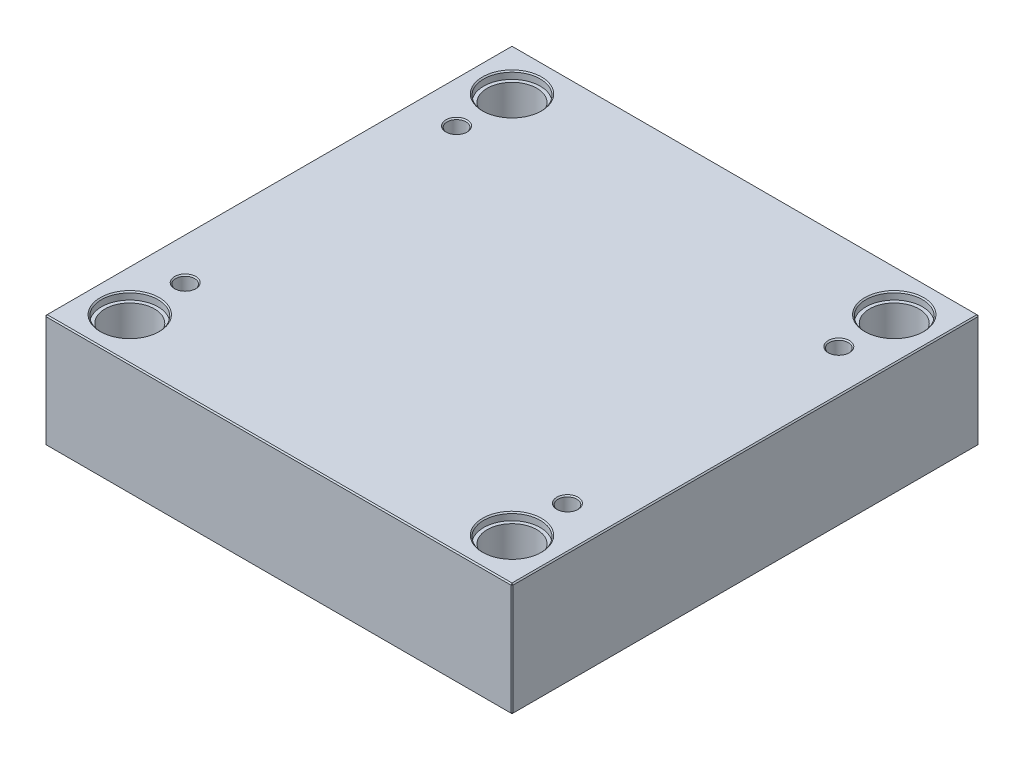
ISO-10303-21;
HEADER;
FILE_DESCRIPTION(('STEP AP214'),'2;1');
FILE_NAME('part.step','',(''),(''),'','','');
FILE_SCHEMA(('AUTOMOTIVE_DESIGN { 1 0 10303 214 1 1 1 1 }'));
ENDSEC;
DATA;
#1=APPLICATION_CONTEXT('core data for automotive mechanical design processes');
#2=APPLICATION_PROTOCOL_DEFINITION('international standard','automotive_design',2000,#1);
#3=PRODUCT_CONTEXT('',#1,'mechanical');
#4=PRODUCT('Part','Part','',(#3));
#5=PRODUCT_RELATED_PRODUCT_CATEGORY('part','',(#4));
#6=PRODUCT_DEFINITION_FORMATION('','',#4);
#7=PRODUCT_DEFINITION_CONTEXT('part definition',#1,'design');
#8=PRODUCT_DEFINITION('design','',#6,#7);
#9=PRODUCT_DEFINITION_SHAPE('','',#8);
#10=(LENGTH_UNIT() NAMED_UNIT(*) SI_UNIT(.MILLI.,.METRE.));
#11=(NAMED_UNIT(*) PLANE_ANGLE_UNIT() SI_UNIT($,.RADIAN.));
#12=(NAMED_UNIT(*) SI_UNIT($,.STERADIAN.) SOLID_ANGLE_UNIT());
#13=UNCERTAINTY_MEASURE_WITH_UNIT(LENGTH_MEASURE(1.E-05),#10,'distance_accuracy_value','');
#14=(GEOMETRIC_REPRESENTATION_CONTEXT(3) GLOBAL_UNCERTAINTY_ASSIGNED_CONTEXT((#13)) GLOBAL_UNIT_ASSIGNED_CONTEXT((#10,
#11,#12)) REPRESENTATION_CONTEXT('',''));
#15=CARTESIAN_POINT('',(0.,0.,0.));
#16=DIRECTION('',(0.,0.,1.));
#17=DIRECTION('',(1.,0.,0.));
#18=AXIS2_PLACEMENT_3D('',#15,#16,#17);
#19=CARTESIAN_POINT('',(-162.,0.,-162.));
#20=DIRECTION('',(0.,1.,0.));
#21=DIRECTION('',(0.,0.,1.));
#22=AXIS2_PLACEMENT_3D('',#19,#20,#21);
#23=CYLINDRICAL_SURFACE('',#22,21.);
#24=CARTESIAN_POINT('',(-162.,0.999999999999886,-162.));
#25=DIRECTION('',(0.,1.,0.));
#26=DIRECTION('',(0.,0.,1.));
#27=AXIS2_PLACEMENT_3D('',#24,#25,#26);
#28=CIRCLE('',#27,21.);
#29=CARTESIAN_POINT('',(-162.,0.999999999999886,-141.));
#30=VERTEX_POINT('',#29);
#31=EDGE_CURVE('E472',#30,#30,#28,.F.);
#32=ORIENTED_EDGE('',*,*,#31,.T.);
#33=EDGE_LOOP('',(#32));
#34=FACE_BOUND('',#33,.T.);
#35=CARTESIAN_POINT('',(-162.,89.7,-162.));
#36=DIRECTION('',(0.,1.,0.));
#37=DIRECTION('',(0.,0.,1.));
#38=AXIS2_PLACEMENT_3D('',#35,#36,#37);
#39=CIRCLE('',#38,21.);
#40=CARTESIAN_POINT('',(-162.,89.7,-141.));
#41=VERTEX_POINT('',#40);
#42=EDGE_CURVE('E221',#41,#41,#39,.F.);
#43=ORIENTED_EDGE('',*,*,#42,.F.);
#44=EDGE_LOOP('',(#43));
#45=FACE_BOUND('',#44,.T.);
#46=ADVANCED_FACE('F16',(#34,#45),#23,.F.);
#47=CARTESIAN_POINT('',(162.,0.,-162.));
#48=DIRECTION('',(0.,1.,0.));
#49=DIRECTION('',(0.,0.,1.));
#50=AXIS2_PLACEMENT_3D('',#47,#48,#49);
#51=CYLINDRICAL_SURFACE('',#50,21.);
#52=CARTESIAN_POINT('',(162.,0.999999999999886,-162.));
#53=DIRECTION('',(0.,1.,0.));
#54=DIRECTION('',(0.,0.,1.));
#55=AXIS2_PLACEMENT_3D('',#52,#53,#54);
#56=CIRCLE('',#55,21.);
#57=CARTESIAN_POINT('',(162.,0.999999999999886,-141.));
#58=VERTEX_POINT('',#57);
#59=EDGE_CURVE('E474',#58,#58,#56,.F.);
#60=ORIENTED_EDGE('',*,*,#59,.T.);
#61=EDGE_LOOP('',(#60));
#62=FACE_BOUND('',#61,.T.);
#63=CARTESIAN_POINT('',(162.,89.7,-162.));
#64=DIRECTION('',(0.,1.,0.));
#65=DIRECTION('',(0.,0.,1.));
#66=AXIS2_PLACEMENT_3D('',#63,#64,#65);
#67=CIRCLE('',#66,21.);
#68=CARTESIAN_POINT('',(162.,89.7,-141.));
#69=VERTEX_POINT('',#68);
#70=EDGE_CURVE('E218',#69,#69,#67,.F.);
#71=ORIENTED_EDGE('',*,*,#70,.F.);
#72=EDGE_LOOP('',(#71));
#73=FACE_BOUND('',#72,.T.);
#74=ADVANCED_FACE('F263',(#62,#73),#51,.F.);
#75=CARTESIAN_POINT('',(162.,0.,162.));
#76=DIRECTION('',(0.,1.,0.));
#77=DIRECTION('',(0.,0.,1.));
#78=AXIS2_PLACEMENT_3D('',#75,#76,#77);
#79=CYLINDRICAL_SURFACE('',#78,21.);
#80=CARTESIAN_POINT('',(162.,1.00000000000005,162.));
#81=DIRECTION('',(0.,1.,0.));
#82=DIRECTION('',(0.,0.,1.));
#83=AXIS2_PLACEMENT_3D('',#80,#81,#82);
#84=CIRCLE('',#83,21.);
#85=CARTESIAN_POINT('',(162.,1.00000000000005,183.));
#86=VERTEX_POINT('',#85);
#87=EDGE_CURVE('E477',#86,#86,#84,.F.);
#88=ORIENTED_EDGE('',*,*,#87,.T.);
#89=EDGE_LOOP('',(#88));
#90=FACE_BOUND('',#89,.T.);
#91=CARTESIAN_POINT('',(162.,89.7,162.));
#92=DIRECTION('',(0.,1.,0.));
#93=DIRECTION('',(0.,0.,1.));
#94=AXIS2_PLACEMENT_3D('',#91,#92,#93);
#95=CIRCLE('',#94,21.);
#96=CARTESIAN_POINT('',(162.,89.7,183.));
#97=VERTEX_POINT('',#96);
#98=EDGE_CURVE('E214',#97,#97,#95,.F.);
#99=ORIENTED_EDGE('',*,*,#98,.F.);
#100=EDGE_LOOP('',(#99));
#101=FACE_BOUND('',#100,.T.);
#102=ADVANCED_FACE('F270',(#90,#101),#79,.F.);
#103=CARTESIAN_POINT('',(-162.,0.,162.));
#104=DIRECTION('',(0.,1.,0.));
#105=DIRECTION('',(0.,0.,1.));
#106=AXIS2_PLACEMENT_3D('',#103,#104,#105);
#107=CYLINDRICAL_SURFACE('',#106,21.);
#108=CARTESIAN_POINT('',(-162.,0.999999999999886,162.));
#109=DIRECTION('',(0.,1.,0.));
#110=DIRECTION('',(0.,0.,1.));
#111=AXIS2_PLACEMENT_3D('',#108,#109,#110);
#112=CIRCLE('',#111,21.);
#113=CARTESIAN_POINT('',(-162.,0.999999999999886,183.));
#114=VERTEX_POINT('',#113);
#115=EDGE_CURVE('E480',#114,#114,#112,.F.);
#116=ORIENTED_EDGE('',*,*,#115,.T.);
#117=EDGE_LOOP('',(#116));
#118=FACE_BOUND('',#117,.T.);
#119=CARTESIAN_POINT('',(-162.,89.7,162.));
#120=DIRECTION('',(0.,1.,0.));
#121=DIRECTION('',(0.,0.,1.));
#122=AXIS2_PLACEMENT_3D('',#119,#120,#121);
#123=CIRCLE('',#122,21.);
#124=CARTESIAN_POINT('',(-162.,89.7,183.));
#125=VERTEX_POINT('',#124);
#126=EDGE_CURVE('E211',#125,#125,#123,.F.);
#127=ORIENTED_EDGE('',*,*,#126,.F.);
#128=EDGE_LOOP('',(#127));
#129=FACE_BOUND('',#128,.T.);
#130=ADVANCED_FACE('F277',(#118,#129),#107,.F.);
#131=CARTESIAN_POINT('',(-198.,96.,198.));
#132=DIRECTION('',(1.,0.,0.));
#133=DIRECTION('',(0.,0.,-1.));
#134=AXIS2_PLACEMENT_3D('',#131,#132,#133);
#135=PLANE('',#134);
#136=DIRECTION('',(0.,-1.,0.));
#137=VECTOR('',#136,1.);
#138=CARTESIAN_POINT('',(-198.,96.,-197.));
#139=LINE('',#138,#137);
#140=CARTESIAN_POINT('',(-198.,95.,-197.));
#141=VERTEX_POINT('',#140);
#142=CARTESIAN_POINT('',(-198.,1.,-197.));
#143=VERTEX_POINT('',#142);
#144=EDGE_CURVE('E487',#141,#143,#139,.T.);
#145=ORIENTED_EDGE('',*,*,#144,.T.);
#146=DIRECTION('',(0.,0.,1.));
#147=VECTOR('',#146,1.);
#148=CARTESIAN_POINT('',(-198.,1.,198.));
#149=LINE('',#148,#147);
#150=CARTESIAN_POINT('',(-198.,1.,197.));
#151=VERTEX_POINT('',#150);
#152=EDGE_CURVE('E490',#143,#151,#149,.T.);
#153=ORIENTED_EDGE('',*,*,#152,.T.);
#154=DIRECTION('',(0.,1.,0.));
#155=VECTOR('',#154,1.);
#156=CARTESIAN_POINT('',(-198.,96.,197.));
#157=LINE('',#156,#155);
#158=CARTESIAN_POINT('',(-198.,95.,197.));
#159=VERTEX_POINT('',#158);
#160=EDGE_CURVE('E485',#151,#159,#157,.T.);
#161=ORIENTED_EDGE('',*,*,#160,.T.);
#162=DIRECTION('',(0.,0.,-1.));
#163=VECTOR('',#162,1.);
#164=CARTESIAN_POINT('',(-198.,95.,-198.));
#165=LINE('',#164,#163);
#166=EDGE_CURVE('E483',#159,#141,#165,.T.);
#167=ORIENTED_EDGE('',*,*,#166,.T.);
#168=EDGE_LOOP('',(#145,#153,#161,#167));
#169=FACE_BOUND('',#168,.T.);
#170=ADVANCED_FACE('F298',(#169),#135,.F.);
#171=CARTESIAN_POINT('',(198.,96.,198.));
#172=DIRECTION('',(0.,0.,-1.));
#173=DIRECTION('',(-1.,0.,0.));
#174=AXIS2_PLACEMENT_3D('',#171,#172,#173);
#175=PLANE('',#174);
#176=DIRECTION('',(-1.,0.,0.));
#177=VECTOR('',#176,1.);
#178=CARTESIAN_POINT('',(-198.,95.,198.));
#179=LINE('',#178,#177);
#180=CARTESIAN_POINT('',(197.,95.,198.));
#181=VERTEX_POINT('',#180);
#182=CARTESIAN_POINT('',(-197.,95.,198.));
#183=VERTEX_POINT('',#182);
#184=EDGE_CURVE('E509',#181,#183,#179,.T.);
#185=ORIENTED_EDGE('',*,*,#184,.T.);
#186=DIRECTION('',(0.,-1.,0.));
#187=VECTOR('',#186,1.);
#188=CARTESIAN_POINT('',(-197.,96.,198.));
#189=LINE('',#188,#187);
#190=CARTESIAN_POINT('',(-197.,1.,198.));
#191=VERTEX_POINT('',#190);
#192=EDGE_CURVE('E515',#183,#191,#189,.T.);
#193=ORIENTED_EDGE('',*,*,#192,.T.);
#194=DIRECTION('',(1.,0.,0.));
#195=VECTOR('',#194,1.);
#196=CARTESIAN_POINT('',(198.,1.,198.));
#197=LINE('',#196,#195);
#198=CARTESIAN_POINT('',(197.,1.,198.));
#199=VERTEX_POINT('',#198);
#200=EDGE_CURVE('E513',#191,#199,#197,.T.);
#201=ORIENTED_EDGE('',*,*,#200,.T.);
#202=DIRECTION('',(0.,1.,0.));
#203=VECTOR('',#202,1.);
#204=CARTESIAN_POINT('',(197.,96.,198.));
#205=LINE('',#204,#203);
#206=EDGE_CURVE('E511',#199,#181,#205,.T.);
#207=ORIENTED_EDGE('',*,*,#206,.T.);
#208=EDGE_LOOP('',(#185,#193,#201,#207));
#209=FACE_BOUND('',#208,.T.);
#210=ADVANCED_FACE('F294',(#209),#175,.F.);
#211=CARTESIAN_POINT('',(198.,96.,198.));
#212=DIRECTION('',(-1.,0.,0.));
#213=DIRECTION('',(0.,0.,1.));
#214=AXIS2_PLACEMENT_3D('',#211,#212,#213);
#215=PLANE('',#214);
#216=DIRECTION('',(0.,0.,-1.));
#217=VECTOR('',#216,1.);
#218=CARTESIAN_POINT('',(198.,1.,198.));
#219=LINE('',#218,#217);
#220=CARTESIAN_POINT('',(198.,1.,197.));
#221=VERTEX_POINT('',#220);
#222=CARTESIAN_POINT('',(198.,1.,-197.));
#223=VERTEX_POINT('',#222);
#224=EDGE_CURVE('E504',#221,#223,#219,.T.);
#225=ORIENTED_EDGE('',*,*,#224,.T.);
#226=DIRECTION('',(0.,1.,0.));
#227=VECTOR('',#226,1.);
#228=CARTESIAN_POINT('',(198.,96.,-197.));
#229=LINE('',#228,#227);
#230=CARTESIAN_POINT('',(198.,95.,-197.));
#231=VERTEX_POINT('',#230);
#232=EDGE_CURVE('E506',#223,#231,#229,.T.);
#233=ORIENTED_EDGE('',*,*,#232,.T.);
#234=DIRECTION('',(0.,0.,1.));
#235=VECTOR('',#234,1.);
#236=CARTESIAN_POINT('',(198.,95.,198.));
#237=LINE('',#236,#235);
#238=CARTESIAN_POINT('',(198.,95.,197.));
#239=VERTEX_POINT('',#238);
#240=EDGE_CURVE('E500',#231,#239,#237,.T.);
#241=ORIENTED_EDGE('',*,*,#240,.T.);
#242=DIRECTION('',(0.,-1.,0.));
#243=VECTOR('',#242,1.);
#244=CARTESIAN_POINT('',(198.,96.,197.));
#245=LINE('',#244,#243);
#246=EDGE_CURVE('E502',#239,#221,#245,.T.);
#247=ORIENTED_EDGE('',*,*,#246,.T.);
#248=EDGE_LOOP('',(#225,#233,#241,#247));
#249=FACE_BOUND('',#248,.T.);
#250=ADVANCED_FACE('F290',(#249),#215,.F.);
#251=CARTESIAN_POINT('',(198.,96.,-198.));
#252=DIRECTION('',(0.,0.,1.));
#253=DIRECTION('',(1.,0.,0.));
#254=AXIS2_PLACEMENT_3D('',#251,#252,#253);
#255=PLANE('',#254);
#256=DIRECTION('',(0.,-1.,0.));
#257=VECTOR('',#256,1.);
#258=CARTESIAN_POINT('',(197.,96.,-198.));
#259=LINE('',#258,#257);
#260=CARTESIAN_POINT('',(197.,95.,-198.));
#261=VERTEX_POINT('',#260);
#262=CARTESIAN_POINT('',(197.,1.,-198.));
#263=VERTEX_POINT('',#262);
#264=EDGE_CURVE('E494',#261,#263,#259,.T.);
#265=ORIENTED_EDGE('',*,*,#264,.T.);
#266=DIRECTION('',(-1.,0.,0.));
#267=VECTOR('',#266,1.);
#268=CARTESIAN_POINT('',(198.,1.,-198.));
#269=LINE('',#268,#267);
#270=CARTESIAN_POINT('',(-197.,1.,-198.));
#271=VERTEX_POINT('',#270);
#272=EDGE_CURVE('E138',#263,#271,#269,.T.);
#273=ORIENTED_EDGE('',*,*,#272,.T.);
#274=DIRECTION('',(0.,1.,0.));
#275=VECTOR('',#274,1.);
#276=CARTESIAN_POINT('',(-197.,96.,-198.));
#277=LINE('',#276,#275);
#278=CARTESIAN_POINT('',(-197.,95.,-198.));
#279=VERTEX_POINT('',#278);
#280=EDGE_CURVE('E496',#271,#279,#277,.T.);
#281=ORIENTED_EDGE('',*,*,#280,.T.);
#282=DIRECTION('',(1.,0.,0.));
#283=VECTOR('',#282,1.);
#284=CARTESIAN_POINT('',(198.,95.,-198.));
#285=LINE('',#284,#283);
#286=EDGE_CURVE('E492',#279,#261,#285,.T.);
#287=ORIENTED_EDGE('',*,*,#286,.T.);
#288=EDGE_LOOP('',(#265,#273,#281,#287));
#289=FACE_BOUND('',#288,.T.);
#290=ADVANCED_FACE('F282',(#289),#255,.F.);
#291=CARTESIAN_POINT('',(0.,96.,0.));
#292=DIRECTION('',(0.,1.,0.));
#293=DIRECTION('',(0.,0.,1.));
#294=AXIS2_PLACEMENT_3D('',#291,#292,#293);
#295=PLANE('',#294);
#296=CARTESIAN_POINT('',(162.,96.,162.));
#297=DIRECTION('',(0.,1.,0.));
#298=DIRECTION('',(0.,0.,1.));
#299=AXIS2_PLACEMENT_3D('',#296,#297,#298);
#300=CIRCLE('',#299,25.);
#301=CARTESIAN_POINT('',(162.,96.,187.));
#302=VERTEX_POINT('',#301);
#303=EDGE_CURVE('E236',#302,#302,#300,.F.);
#304=ORIENTED_EDGE('',*,*,#303,.T.);
#305=EDGE_LOOP('',(#304));
#306=FACE_BOUND('',#305,.T.);
#307=CARTESIAN_POINT('',(-162.,96.,162.));
#308=DIRECTION('',(0.,1.,0.));
#309=DIRECTION('',(0.,0.,1.));
#310=AXIS2_PLACEMENT_3D('',#307,#308,#309);
#311=CIRCLE('',#310,25.);
#312=CARTESIAN_POINT('',(-162.,96.,187.));
#313=VERTEX_POINT('',#312);
#314=EDGE_CURVE('E233',#313,#313,#311,.F.);
#315=ORIENTED_EDGE('',*,*,#314,.T.);
#316=EDGE_LOOP('',(#315));
#317=FACE_BOUND('',#316,.T.);
#318=CARTESIAN_POINT('',(162.,96.,-162.));
#319=DIRECTION('',(0.,1.,0.));
#320=DIRECTION('',(0.,0.,1.));
#321=AXIS2_PLACEMENT_3D('',#318,#319,#320);
#322=CIRCLE('',#321,25.);
#323=CARTESIAN_POINT('',(162.,96.,-137.));
#324=VERTEX_POINT('',#323);
#325=EDGE_CURVE('E230',#324,#324,#322,.F.);
#326=ORIENTED_EDGE('',*,*,#325,.T.);
#327=EDGE_LOOP('',(#326));
#328=FACE_BOUND('',#327,.T.);
#329=CARTESIAN_POINT('',(-162.,96.,-162.));
#330=DIRECTION('',(0.,1.,0.));
#331=DIRECTION('',(0.,0.,1.));
#332=AXIS2_PLACEMENT_3D('',#329,#330,#331);
#333=CIRCLE('',#332,25.);
#334=CARTESIAN_POINT('',(-162.,96.,-137.));
#335=VERTEX_POINT('',#334);
#336=EDGE_CURVE('E227',#335,#335,#333,.F.);
#337=ORIENTED_EDGE('',*,*,#336,.T.);
#338=EDGE_LOOP('',(#337));
#339=FACE_BOUND('',#338,.T.);
#340=CARTESIAN_POINT('',(-162.,96.,115.));
#341=DIRECTION('',(0.,1.,0.));
#342=DIRECTION('',(0.,0.,1.));
#343=AXIS2_PLACEMENT_3D('',#340,#341,#342);
#344=CIRCLE('',#343,8.9999999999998);
#345=CARTESIAN_POINT('',(-162.,96.,124.));
#346=VERTEX_POINT('',#345);
#347=EDGE_CURVE('E198',#346,#346,#344,.F.);
#348=ORIENTED_EDGE('',*,*,#347,.T.);
#349=EDGE_LOOP('',(#348));
#350=FACE_BOUND('',#349,.T.);
#351=CARTESIAN_POINT('',(162.,96.,115.));
#352=DIRECTION('',(0.,1.,0.));
#353=DIRECTION('',(0.,0.,1.));
#354=AXIS2_PLACEMENT_3D('',#351,#352,#353);
#355=CIRCLE('',#354,8.9999999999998);
#356=CARTESIAN_POINT('',(162.,96.,124.));
#357=VERTEX_POINT('',#356);
#358=EDGE_CURVE('E195',#357,#357,#355,.F.);
#359=ORIENTED_EDGE('',*,*,#358,.T.);
#360=EDGE_LOOP('',(#359));
#361=FACE_BOUND('',#360,.T.);
#362=CARTESIAN_POINT('',(162.,96.,-115.));
#363=DIRECTION('',(0.,1.,0.));
#364=DIRECTION('',(0.,0.,1.));
#365=AXIS2_PLACEMENT_3D('',#362,#363,#364);
#366=CIRCLE('',#365,8.9999999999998);
#367=CARTESIAN_POINT('',(162.,96.,-106.));
#368=VERTEX_POINT('',#367);
#369=EDGE_CURVE('E192',#368,#368,#366,.F.);
#370=ORIENTED_EDGE('',*,*,#369,.T.);
#371=EDGE_LOOP('',(#370));
#372=FACE_BOUND('',#371,.T.);
#373=CARTESIAN_POINT('',(-162.,96.,-115.));
#374=DIRECTION('',(0.,1.,0.));
#375=DIRECTION('',(0.,0.,1.));
#376=AXIS2_PLACEMENT_3D('',#373,#374,#375);
#377=CIRCLE('',#376,8.9999999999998);
#378=CARTESIAN_POINT('',(-162.,96.,-106.));
#379=VERTEX_POINT('',#378);
#380=EDGE_CURVE('E188',#379,#379,#377,.F.);
#381=ORIENTED_EDGE('',*,*,#380,.T.);
#382=EDGE_LOOP('',(#381));
#383=FACE_BOUND('',#382,.T.);
#384=DIRECTION('',(0.,0.,-1.));
#385=VECTOR('',#384,1.);
#386=CARTESIAN_POINT('',(197.,96.,-198.));
#387=LINE('',#386,#385);
#388=CARTESIAN_POINT('',(197.,96.,197.));
#389=VERTEX_POINT('',#388);
#390=CARTESIAN_POINT('',(197.,96.,-197.));
#391=VERTEX_POINT('',#390);
#392=EDGE_CURVE('E31',#389,#391,#387,.T.);
#393=ORIENTED_EDGE('',*,*,#392,.T.);
#394=DIRECTION('',(-1.,0.,0.));
#395=VECTOR('',#394,1.);
#396=CARTESIAN_POINT('',(-198.,96.,-197.));
#397=LINE('',#396,#395);
#398=CARTESIAN_POINT('',(-197.,96.,-197.));
#399=VERTEX_POINT('',#398);
#400=EDGE_CURVE('E189',#391,#399,#397,.T.);
#401=ORIENTED_EDGE('',*,*,#400,.T.);
#402=DIRECTION('',(0.,0.,1.));
#403=VECTOR('',#402,1.);
#404=CARTESIAN_POINT('',(-197.,96.,198.));
#405=LINE('',#404,#403);
#406=CARTESIAN_POINT('',(-197.,96.,197.));
#407=VERTEX_POINT('',#406);
#408=EDGE_CURVE('E518',#399,#407,#405,.T.);
#409=ORIENTED_EDGE('',*,*,#408,.T.);
#410=DIRECTION('',(1.,0.,0.));
#411=VECTOR('',#410,1.);
#412=CARTESIAN_POINT('',(198.,96.,197.));
#413=LINE('',#412,#411);
#414=EDGE_CURVE('E36',#407,#389,#413,.T.);
#415=ORIENTED_EDGE('',*,*,#414,.T.);
#416=EDGE_LOOP('',(#393,#401,#409,#415));
#417=FACE_BOUND('',#416,.T.);
#418=ADVANCED_FACE('F279',(#306,#317,#328,#339,#350,#361,#372,#383,#417),#295,.T.);
#419=CARTESIAN_POINT('',(0.,0.,0.));
#420=DIRECTION('',(0.,1.,0.));
#421=DIRECTION('',(0.,0.,1.));
#422=AXIS2_PLACEMENT_3D('',#419,#420,#421);
#423=PLANE('',#422);
#424=CARTESIAN_POINT('',(-162.,0.,-162.));
#425=DIRECTION('',(0.,1.,0.));
#426=DIRECTION('',(0.,0.,1.));
#427=AXIS2_PLACEMENT_3D('',#424,#425,#426);
#428=CIRCLE('',#427,22.);
#429=CARTESIAN_POINT('',(-162.,0.,-140.));
#430=VERTEX_POINT('',#429);
#431=EDGE_CURVE('E469',#430,#430,#428,.T.);
#432=ORIENTED_EDGE('',*,*,#431,.T.);
#433=EDGE_LOOP('',(#432));
#434=FACE_BOUND('',#433,.T.);
#435=CARTESIAN_POINT('',(162.,0.,-162.));
#436=DIRECTION('',(0.,1.,0.));
#437=DIRECTION('',(0.,0.,1.));
#438=AXIS2_PLACEMENT_3D('',#435,#436,#437);
#439=CIRCLE('',#438,22.);
#440=CARTESIAN_POINT('',(162.,0.,-140.));
#441=VERTEX_POINT('',#440);
#442=EDGE_CURVE('E466',#441,#441,#439,.T.);
#443=ORIENTED_EDGE('',*,*,#442,.T.);
#444=EDGE_LOOP('',(#443));
#445=FACE_BOUND('',#444,.T.);
#446=CARTESIAN_POINT('',(162.,0.,162.));
#447=DIRECTION('',(0.,1.,0.));
#448=DIRECTION('',(0.,0.,1.));
#449=AXIS2_PLACEMENT_3D('',#446,#447,#448);
#450=CIRCLE('',#449,22.);
#451=CARTESIAN_POINT('',(162.,0.,184.));
#452=VERTEX_POINT('',#451);
#453=EDGE_CURVE('E463',#452,#452,#450,.T.);
#454=ORIENTED_EDGE('',*,*,#453,.T.);
#455=EDGE_LOOP('',(#454));
#456=FACE_BOUND('',#455,.T.);
#457=CARTESIAN_POINT('',(-162.,0.,162.));
#458=DIRECTION('',(0.,1.,0.));
#459=DIRECTION('',(0.,0.,1.));
#460=AXIS2_PLACEMENT_3D('',#457,#458,#459);
#461=CIRCLE('',#460,22.);
#462=CARTESIAN_POINT('',(-162.,0.,184.));
#463=VERTEX_POINT('',#462);
#464=EDGE_CURVE('E460',#463,#463,#461,.T.);
#465=ORIENTED_EDGE('',*,*,#464,.T.);
#466=EDGE_LOOP('',(#465));
#467=FACE_BOUND('',#466,.T.);
#468=DIRECTION('',(0.,0.,1.));
#469=VECTOR('',#468,1.);
#470=CARTESIAN_POINT('',(197.,0.,0.));
#471=LINE('',#470,#469);
#472=CARTESIAN_POINT('',(197.,0.,-197.));
#473=VERTEX_POINT('',#472);
#474=CARTESIAN_POINT('',(197.,0.,197.));
#475=VERTEX_POINT('',#474);
#476=EDGE_CURVE('E108',#473,#475,#471,.T.);
#477=ORIENTED_EDGE('',*,*,#476,.T.);
#478=DIRECTION('',(-1.,0.,0.));
#479=VECTOR('',#478,1.);
#480=CARTESIAN_POINT('',(0.,0.,197.));
#481=LINE('',#480,#479);
#482=CARTESIAN_POINT('',(-197.,0.,197.));
#483=VERTEX_POINT('',#482);
#484=EDGE_CURVE('E458',#475,#483,#481,.T.);
#485=ORIENTED_EDGE('',*,*,#484,.T.);
#486=DIRECTION('',(0.,0.,-1.));
#487=VECTOR('',#486,1.);
#488=CARTESIAN_POINT('',(-197.,0.,0.));
#489=LINE('',#488,#487);
#490=CARTESIAN_POINT('',(-197.,0.,-197.));
#491=VERTEX_POINT('',#490);
#492=EDGE_CURVE('E110',#483,#491,#489,.T.);
#493=ORIENTED_EDGE('',*,*,#492,.T.);
#494=DIRECTION('',(1.,0.,0.));
#495=VECTOR('',#494,1.);
#496=CARTESIAN_POINT('',(0.,0.,-197.));
#497=LINE('',#496,#495);
#498=EDGE_CURVE('E104',#491,#473,#497,.T.);
#499=ORIENTED_EDGE('',*,*,#498,.T.);
#500=EDGE_LOOP('',(#477,#485,#493,#499));
#501=FACE_BOUND('',#500,.T.);
#502=ADVANCED_FACE('F106',(#434,#445,#456,#467,#501),#423,.F.);
#503=CARTESIAN_POINT('',(-162.,0.,-162.));
#504=DIRECTION('',(0.,-1.,0.));
#505=DIRECTION('',(0.,0.,-1.));
#506=AXIS2_PLACEMENT_3D('',#503,#504,#505);
#507=CONICAL_SURFACE('',#506,22.,0.78539816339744);
#508=ORIENTED_EDGE('',*,*,#31,.F.);
#509=EDGE_LOOP('',(#508));
#510=FACE_BOUND('',#509,.T.);
#511=ORIENTED_EDGE('',*,*,#431,.F.);
#512=EDGE_LOOP('',(#511));
#513=FACE_BOUND('',#512,.T.);
#514=ADVANCED_FACE('F286',(#510,#513),#507,.F.);
#515=CARTESIAN_POINT('',(162.,0.,-162.));
#516=DIRECTION('',(0.,-1.,0.));
#517=DIRECTION('',(0.,0.,-1.));
#518=AXIS2_PLACEMENT_3D('',#515,#516,#517);
#519=CONICAL_SURFACE('',#518,22.,0.78539816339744);
#520=ORIENTED_EDGE('',*,*,#59,.F.);
#521=EDGE_LOOP('',(#520));
#522=FACE_BOUND('',#521,.T.);
#523=ORIENTED_EDGE('',*,*,#442,.F.);
#524=EDGE_LOOP('',(#523));
#525=FACE_BOUND('',#524,.T.);
#526=ADVANCED_FACE('F305',(#522,#525),#519,.F.);
#527=CARTESIAN_POINT('',(162.,0.,162.));
#528=DIRECTION('',(0.,-1.,0.));
#529=DIRECTION('',(0.,0.,-1.));
#530=AXIS2_PLACEMENT_3D('',#527,#528,#529);
#531=CONICAL_SURFACE('',#530,22.,0.785398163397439);
#532=ORIENTED_EDGE('',*,*,#87,.F.);
#533=EDGE_LOOP('',(#532));
#534=FACE_BOUND('',#533,.T.);
#535=ORIENTED_EDGE('',*,*,#453,.F.);
#536=EDGE_LOOP('',(#535));
#537=FACE_BOUND('',#536,.T.);
#538=ADVANCED_FACE('F309',(#534,#537),#531,.F.);
#539=CARTESIAN_POINT('',(-162.,0.,162.));
#540=DIRECTION('',(0.,-1.,0.));
#541=DIRECTION('',(0.,0.,-1.));
#542=AXIS2_PLACEMENT_3D('',#539,#540,#541);
#543=CONICAL_SURFACE('',#542,22.,0.78539816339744);
#544=ORIENTED_EDGE('',*,*,#115,.F.);
#545=EDGE_LOOP('',(#544));
#546=FACE_BOUND('',#545,.T.);
#547=ORIENTED_EDGE('',*,*,#464,.F.);
#548=EDGE_LOOP('',(#547));
#549=FACE_BOUND('',#548,.T.);
#550=ADVANCED_FACE('F313',(#546,#549),#543,.F.);
#551=CARTESIAN_POINT('',(198.,96.,197.));
#552=DIRECTION('',(-0.707106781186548,0.,-0.707106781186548));
#553=DIRECTION('',(0.,-1.,0.));
#554=AXIS2_PLACEMENT_3D('',#551,#552,#553);
#555=PLANE('',#554);
#556=DIRECTION('',(-0.707106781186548,0.,0.707106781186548));
#557=VECTOR('',#556,1.);
#558=CARTESIAN_POINT('',(197.,95.,198.));
#559=LINE('',#558,#557);
#560=EDGE_CURVE('E126',#181,#239,#559,.F.);
#561=ORIENTED_EDGE('',*,*,#560,.F.);
#562=ORIENTED_EDGE('',*,*,#206,.F.);
#563=DIRECTION('',(0.707106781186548,0.,-0.707106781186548));
#564=VECTOR('',#563,1.);
#565=CARTESIAN_POINT('',(197.,1.,198.));
#566=LINE('',#565,#564);
#567=EDGE_CURVE('E180',#221,#199,#566,.F.);
#568=ORIENTED_EDGE('',*,*,#567,.F.);
#569=ORIENTED_EDGE('',*,*,#246,.F.);
#570=EDGE_LOOP('',(#561,#562,#568,#569));
#571=FACE_BOUND('',#570,.T.);
#572=ADVANCED_FACE('F317',(#571),#555,.F.);
#573=CARTESIAN_POINT('',(197.,95.,198.));
#574=DIRECTION('',(0.577350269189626,0.577350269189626,0.577350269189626));
#575=DIRECTION('',(0.707106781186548,0.,-0.707106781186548));
#576=AXIS2_PLACEMENT_3D('',#573,#574,#575);
#577=PLANE('',#576);
#578=DIRECTION('',(0.,-0.707106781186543,0.707106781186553));
#579=VECTOR('',#578,1.);
#580=CARTESIAN_POINT('',(197.,95.,198.));
#581=LINE('',#580,#579);
#582=EDGE_CURVE('E175',#181,#389,#581,.F.);
#583=ORIENTED_EDGE('',*,*,#582,.F.);
#584=ORIENTED_EDGE('',*,*,#560,.T.);
#585=DIRECTION('',(-0.707106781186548,0.707106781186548,0.));
#586=VECTOR('',#585,1.);
#587=CARTESIAN_POINT('',(197.5,95.5,197.));
#588=LINE('',#587,#586);
#589=EDGE_CURVE('E177',#389,#239,#588,.F.);
#590=ORIENTED_EDGE('',*,*,#589,.F.);
#591=EDGE_LOOP('',(#583,#584,#590));
#592=FACE_BOUND('',#591,.T.);
#593=ADVANCED_FACE('F385',(#592),#577,.T.);
#594=CARTESIAN_POINT('',(197.,1.,198.));
#595=DIRECTION('',(0.57735026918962,-0.577350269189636,0.57735026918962));
#596=DIRECTION('',(0.,-0.707106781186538,-0.707106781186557));
#597=AXIS2_PLACEMENT_3D('',#594,#595,#596);
#598=PLANE('',#597);
#599=DIRECTION('',(-0.707106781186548,-0.707106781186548,0.));
#600=VECTOR('',#599,1.);
#601=CARTESIAN_POINT('',(197.5,0.500000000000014,197.));
#602=LINE('',#601,#600);
#603=EDGE_CURVE('E124',#221,#475,#602,.T.);
#604=ORIENTED_EDGE('',*,*,#603,.F.);
#605=ORIENTED_EDGE('',*,*,#567,.T.);
#606=DIRECTION('',(0.,0.707106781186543,0.707106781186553));
#607=VECTOR('',#606,1.);
#608=CARTESIAN_POINT('',(197.,1.,198.));
#609=LINE('',#608,#607);
#610=EDGE_CURVE('E172',#475,#199,#609,.T.);
#611=ORIENTED_EDGE('',*,*,#610,.F.);
#612=EDGE_LOOP('',(#604,#605,#611));
#613=FACE_BOUND('',#612,.T.);
#614=ADVANCED_FACE('F381',(#613),#598,.T.);
#615=CARTESIAN_POINT('',(197.,96.,0.));
#616=DIRECTION('',(0.707106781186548,0.707106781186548,0.));
#617=DIRECTION('',(0.,0.,1.));
#618=AXIS2_PLACEMENT_3D('',#615,#616,#617);
#619=PLANE('',#618);
#620=ORIENTED_EDGE('',*,*,#589,.T.);
#621=ORIENTED_EDGE('',*,*,#240,.F.);
#622=DIRECTION('',(0.707106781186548,-0.707106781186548,0.));
#623=VECTOR('',#622,1.);
#624=CARTESIAN_POINT('',(198.,95.,-197.));
#625=LINE('',#624,#623);
#626=EDGE_CURVE('E166',#391,#231,#625,.T.);
#627=ORIENTED_EDGE('',*,*,#626,.F.);
#628=ORIENTED_EDGE('',*,*,#392,.F.);
#629=EDGE_LOOP('',(#620,#621,#627,#628));
#630=FACE_BOUND('',#629,.T.);
#631=ADVANCED_FACE('F377',(#630),#619,.T.);
#632=CARTESIAN_POINT('',(0.,96.,197.));
#633=DIRECTION('',(0.,0.707106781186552,0.707106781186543));
#634=DIRECTION('',(-1.,0.,0.));
#635=AXIS2_PLACEMENT_3D('',#632,#633,#634);
#636=PLANE('',#635);
#637=ORIENTED_EDGE('',*,*,#582,.T.);
#638=ORIENTED_EDGE('',*,*,#414,.F.);
#639=DIRECTION('',(0.,0.707106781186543,-0.707106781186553));
#640=VECTOR('',#639,1.);
#641=CARTESIAN_POINT('',(-197.,95.5,197.5));
#642=LINE('',#641,#640);
#643=EDGE_CURVE('E163',#183,#407,#642,.T.);
#644=ORIENTED_EDGE('',*,*,#643,.F.);
#645=ORIENTED_EDGE('',*,*,#184,.F.);
#646=EDGE_LOOP('',(#637,#638,#644,#645));
#647=FACE_BOUND('',#646,.T.);
#648=ADVANCED_FACE('F373',(#647),#636,.T.);
#649=CARTESIAN_POINT('',(-197.,96.,198.));
#650=DIRECTION('',(0.707106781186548,0.,-0.707106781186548));
#651=DIRECTION('',(0.,-1.,0.));
#652=AXIS2_PLACEMENT_3D('',#649,#650,#651);
#653=PLANE('',#652);
#654=DIRECTION('',(0.707106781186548,0.,0.707106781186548));
#655=VECTOR('',#654,1.);
#656=CARTESIAN_POINT('',(-197.,1.,198.));
#657=LINE('',#656,#655);
#658=EDGE_CURVE('E157',#191,#151,#657,.F.);
#659=ORIENTED_EDGE('',*,*,#658,.F.);
#660=ORIENTED_EDGE('',*,*,#192,.F.);
#661=DIRECTION('',(-0.707106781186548,0.,-0.707106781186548));
#662=VECTOR('',#661,1.);
#663=CARTESIAN_POINT('',(-198.,95.,197.));
#664=LINE('',#663,#662);
#665=EDGE_CURVE('E160',#159,#183,#664,.F.);
#666=ORIENTED_EDGE('',*,*,#665,.F.);
#667=ORIENTED_EDGE('',*,*,#160,.F.);
#668=EDGE_LOOP('',(#659,#660,#666,#667));
#669=FACE_BOUND('',#668,.T.);
#670=ADVANCED_FACE('F369',(#669),#653,.F.);
#671=CARTESIAN_POINT('',(198.,1.,198.));
#672=DIRECTION('',(0.,0.707106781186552,-0.707106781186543));
#673=DIRECTION('',(1.,0.,0.));
#674=AXIS2_PLACEMENT_3D('',#671,#672,#673);
#675=PLANE('',#674);
#676=ORIENTED_EDGE('',*,*,#610,.T.);
#677=ORIENTED_EDGE('',*,*,#200,.F.);
#678=DIRECTION('',(0.,-0.707106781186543,-0.707106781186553));
#679=VECTOR('',#678,1.);
#680=CARTESIAN_POINT('',(-197.,1.,198.));
#681=LINE('',#680,#679);
#682=EDGE_CURVE('E135',#483,#191,#681,.F.);
#683=ORIENTED_EDGE('',*,*,#682,.F.);
#684=ORIENTED_EDGE('',*,*,#484,.F.);
#685=EDGE_LOOP('',(#676,#677,#683,#684));
#686=FACE_BOUND('',#685,.T.);
#687=ADVANCED_FACE('F366',(#686),#675,.F.);
#688=CARTESIAN_POINT('',(198.,1.,198.));
#689=DIRECTION('',(-0.707106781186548,0.707106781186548,0.));
#690=DIRECTION('',(0.,0.,-1.));
#691=AXIS2_PLACEMENT_3D('',#688,#689,#690);
#692=PLANE('',#691);
#693=ORIENTED_EDGE('',*,*,#603,.T.);
#694=ORIENTED_EDGE('',*,*,#476,.F.);
#695=DIRECTION('',(0.707106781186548,0.707106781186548,0.));
#696=VECTOR('',#695,1.);
#697=CARTESIAN_POINT('',(197.5,0.499999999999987,-197.));
#698=LINE('',#697,#696);
#699=EDGE_CURVE('E121',#223,#473,#698,.F.);
#700=ORIENTED_EDGE('',*,*,#699,.F.);
#701=ORIENTED_EDGE('',*,*,#224,.F.);
#702=EDGE_LOOP('',(#693,#694,#700,#701));
#703=FACE_BOUND('',#702,.T.);
#704=ADVANCED_FACE('F119',(#703),#692,.F.);
#705=CARTESIAN_POINT('',(197.,96.,-198.));
#706=DIRECTION('',(-0.707106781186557,0.,0.707106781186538));
#707=DIRECTION('',(0.,-1.,0.));
#708=AXIS2_PLACEMENT_3D('',#705,#706,#707);
#709=PLANE('',#708);
#710=DIRECTION('',(0.707106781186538,0.,0.707106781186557));
#711=VECTOR('',#710,1.);
#712=CARTESIAN_POINT('',(198.,95.,-197.));
#713=LINE('',#712,#711);
#714=EDGE_CURVE('E168',#231,#261,#713,.F.);
#715=ORIENTED_EDGE('',*,*,#714,.F.);
#716=ORIENTED_EDGE('',*,*,#232,.F.);
#717=DIRECTION('',(-0.707106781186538,0.,-0.707106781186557));
#718=VECTOR('',#717,1.);
#719=CARTESIAN_POINT('',(197.,1.,-198.));
#720=LINE('',#719,#718);
#721=EDGE_CURVE('E134',#263,#223,#720,.F.);
#722=ORIENTED_EDGE('',*,*,#721,.F.);
#723=ORIENTED_EDGE('',*,*,#264,.F.);
#724=EDGE_LOOP('',(#715,#716,#722,#723));
#725=FACE_BOUND('',#724,.T.);
#726=ADVANCED_FACE('F359',(#725),#709,.F.);
#727=CARTESIAN_POINT('',(198.,95.,-197.));
#728=DIRECTION('',(0.577350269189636,0.57735026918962,-0.57735026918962));
#729=DIRECTION('',(-0.707106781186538,0.,-0.707106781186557));
#730=AXIS2_PLACEMENT_3D('',#727,#728,#729);
#731=PLANE('',#730);
#732=ORIENTED_EDGE('',*,*,#626,.T.);
#733=ORIENTED_EDGE('',*,*,#714,.T.);
#734=DIRECTION('',(0.,0.707106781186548,0.707106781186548));
#735=VECTOR('',#734,1.);
#736=CARTESIAN_POINT('',(197.,95.5,-197.5));
#737=LINE('',#736,#735);
#738=EDGE_CURVE('E152',#391,#261,#737,.F.);
#739=ORIENTED_EDGE('',*,*,#738,.F.);
#740=EDGE_LOOP('',(#732,#733,#739));
#741=FACE_BOUND('',#740,.T.);
#742=ADVANCED_FACE('F355',(#741),#731,.T.);
#743=CARTESIAN_POINT('',(-198.,95.,197.));
#744=DIRECTION('',(-0.577350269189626,0.577350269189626,0.577350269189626));
#745=DIRECTION('',(0.707106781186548,0.,0.707106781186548));
#746=AXIS2_PLACEMENT_3D('',#743,#744,#745);
#747=PLANE('',#746);
#748=ORIENTED_EDGE('',*,*,#665,.T.);
#749=ORIENTED_EDGE('',*,*,#643,.T.);
#750=DIRECTION('',(-0.707106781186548,-0.707106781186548,0.));
#751=VECTOR('',#750,1.);
#752=CARTESIAN_POINT('',(-198.,95.,197.));
#753=LINE('',#752,#751);
#754=EDGE_CURVE('E143',#159,#407,#753,.F.);
#755=ORIENTED_EDGE('',*,*,#754,.F.);
#756=EDGE_LOOP('',(#748,#749,#755));
#757=FACE_BOUND('',#756,.T.);
#758=ADVANCED_FACE('F351',(#757),#747,.T.);
#759=CARTESIAN_POINT('',(-197.,1.,198.));
#760=DIRECTION('',(-0.57735026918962,-0.577350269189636,0.57735026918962));
#761=DIRECTION('',(0.,-0.707106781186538,-0.707106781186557));
#762=AXIS2_PLACEMENT_3D('',#759,#760,#761);
#763=PLANE('',#762);
#764=ORIENTED_EDGE('',*,*,#682,.T.);
#765=ORIENTED_EDGE('',*,*,#658,.T.);
#766=DIRECTION('',(-0.707106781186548,0.707106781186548,0.));
#767=VECTOR('',#766,1.);
#768=CARTESIAN_POINT('',(-197.5,0.500000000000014,197.));
#769=LINE('',#768,#767);
#770=EDGE_CURVE('E139',#483,#151,#769,.T.);
#771=ORIENTED_EDGE('',*,*,#770,.F.);
#772=EDGE_LOOP('',(#764,#765,#771));
#773=FACE_BOUND('',#772,.T.);
#774=ADVANCED_FACE('F348',(#773),#763,.T.);
#775=CARTESIAN_POINT('',(197.,1.,-198.));
#776=DIRECTION('',(0.577350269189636,-0.57735026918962,-0.57735026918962));
#777=DIRECTION('',(-0.707106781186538,0.,-0.707106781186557));
#778=AXIS2_PLACEMENT_3D('',#775,#776,#777);
#779=PLANE('',#778);
#780=ORIENTED_EDGE('',*,*,#721,.T.);
#781=ORIENTED_EDGE('',*,*,#699,.T.);
#782=DIRECTION('',(0.,-0.707106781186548,0.707106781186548));
#783=VECTOR('',#782,1.);
#784=CARTESIAN_POINT('',(197.,1.,-198.));
#785=LINE('',#784,#783);
#786=EDGE_CURVE('E131',#263,#473,#785,.T.);
#787=ORIENTED_EDGE('',*,*,#786,.F.);
#788=EDGE_LOOP('',(#780,#781,#787));
#789=FACE_BOUND('',#788,.T.);
#790=ADVANCED_FACE('F130',(#789),#779,.T.);
#791=CARTESIAN_POINT('',(0.,96.,-197.));
#792=DIRECTION('',(0.,0.707106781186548,-0.707106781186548));
#793=DIRECTION('',(1.,0.,0.));
#794=AXIS2_PLACEMENT_3D('',#791,#792,#793);
#795=PLANE('',#794);
#796=ORIENTED_EDGE('',*,*,#738,.T.);
#797=ORIENTED_EDGE('',*,*,#286,.F.);
#798=DIRECTION('',(0.,-0.707106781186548,-0.707106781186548));
#799=VECTOR('',#798,1.);
#800=CARTESIAN_POINT('',(-197.,95.,-198.));
#801=LINE('',#800,#799);
#802=EDGE_CURVE('E140',#399,#279,#801,.T.);
#803=ORIENTED_EDGE('',*,*,#802,.F.);
#804=ORIENTED_EDGE('',*,*,#400,.F.);
#805=EDGE_LOOP('',(#796,#797,#803,#804));
#806=FACE_BOUND('',#805,.T.);
#807=ADVANCED_FACE('F341',(#806),#795,.T.);
#808=CARTESIAN_POINT('',(-197.,96.,0.));
#809=DIRECTION('',(-0.707106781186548,0.707106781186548,0.));
#810=DIRECTION('',(0.,0.,-1.));
#811=AXIS2_PLACEMENT_3D('',#808,#809,#810);
#812=PLANE('',#811);
#813=ORIENTED_EDGE('',*,*,#754,.T.);
#814=ORIENTED_EDGE('',*,*,#408,.F.);
#815=DIRECTION('',(0.707106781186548,0.707106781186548,0.));
#816=VECTOR('',#815,1.);
#817=CARTESIAN_POINT('',(-197.5,95.5,-197.));
#818=LINE('',#817,#816);
#819=EDGE_CURVE('E146',#141,#399,#818,.T.);
#820=ORIENTED_EDGE('',*,*,#819,.F.);
#821=ORIENTED_EDGE('',*,*,#166,.F.);
#822=EDGE_LOOP('',(#813,#814,#820,#821));
#823=FACE_BOUND('',#822,.T.);
#824=ADVANCED_FACE('F337',(#823),#812,.T.);
#825=CARTESIAN_POINT('',(-198.,1.,198.));
#826=DIRECTION('',(0.707106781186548,0.707106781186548,0.));
#827=DIRECTION('',(0.,0.,1.));
#828=AXIS2_PLACEMENT_3D('',#825,#826,#827);
#829=PLANE('',#828);
#830=ORIENTED_EDGE('',*,*,#770,.T.);
#831=ORIENTED_EDGE('',*,*,#152,.F.);
#832=DIRECTION('',(0.707106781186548,-0.707106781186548,0.));
#833=VECTOR('',#832,1.);
#834=CARTESIAN_POINT('',(-198.,1.,-197.));
#835=LINE('',#834,#833);
#836=EDGE_CURVE('E529',#491,#143,#835,.F.);
#837=ORIENTED_EDGE('',*,*,#836,.F.);
#838=ORIENTED_EDGE('',*,*,#492,.F.);
#839=EDGE_LOOP('',(#830,#831,#837,#838));
#840=FACE_BOUND('',#839,.T.);
#841=ADVANCED_FACE('F334',(#840),#829,.F.);
#842=CARTESIAN_POINT('',(198.,1.,-198.));
#843=DIRECTION('',(0.,0.707106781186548,0.707106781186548));
#844=DIRECTION('',(-1.,0.,0.));
#845=AXIS2_PLACEMENT_3D('',#842,#843,#844);
#846=PLANE('',#845);
#847=ORIENTED_EDGE('',*,*,#786,.T.);
#848=ORIENTED_EDGE('',*,*,#498,.F.);
#849=DIRECTION('',(0.,0.707106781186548,-0.707106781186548));
#850=VECTOR('',#849,1.);
#851=CARTESIAN_POINT('',(-197.,0.5,-197.5));
#852=LINE('',#851,#850);
#853=EDGE_CURVE('E526',#271,#491,#852,.F.);
#854=ORIENTED_EDGE('',*,*,#853,.F.);
#855=ORIENTED_EDGE('',*,*,#272,.F.);
#856=EDGE_LOOP('',(#847,#848,#854,#855));
#857=FACE_BOUND('',#856,.T.);
#858=ADVANCED_FACE('F137',(#857),#846,.F.);
#859=CARTESIAN_POINT('',(-197.,95.,-198.));
#860=DIRECTION('',(-0.577350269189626,0.577350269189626,-0.577350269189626));
#861=DIRECTION('',(-0.707106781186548,0.,0.707106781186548));
#862=AXIS2_PLACEMENT_3D('',#859,#860,#861);
#863=PLANE('',#862);
#864=ORIENTED_EDGE('',*,*,#819,.T.);
#865=ORIENTED_EDGE('',*,*,#802,.T.);
#866=DIRECTION('',(0.707106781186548,0.,-0.707106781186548));
#867=VECTOR('',#866,1.);
#868=CARTESIAN_POINT('',(-197.,95.,-198.));
#869=LINE('',#868,#867);
#870=EDGE_CURVE('E524',#141,#279,#869,.T.);
#871=ORIENTED_EDGE('',*,*,#870,.F.);
#872=EDGE_LOOP('',(#864,#865,#871));
#873=FACE_BOUND('',#872,.T.);
#874=ADVANCED_FACE('F327',(#873),#863,.T.);
#875=CARTESIAN_POINT('',(-198.,1.,-197.));
#876=DIRECTION('',(-0.577350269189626,-0.577350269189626,-0.577350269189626));
#877=DIRECTION('',(-0.707106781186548,0.,0.707106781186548));
#878=AXIS2_PLACEMENT_3D('',#875,#876,#877);
#879=PLANE('',#878);
#880=ORIENTED_EDGE('',*,*,#853,.T.);
#881=ORIENTED_EDGE('',*,*,#836,.T.);
#882=DIRECTION('',(-0.707106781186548,0.,0.707106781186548));
#883=VECTOR('',#882,1.);
#884=CARTESIAN_POINT('',(-198.,1.,-197.));
#885=LINE('',#884,#883);
#886=EDGE_CURVE('E455',#271,#143,#885,.T.);
#887=ORIENTED_EDGE('',*,*,#886,.F.);
#888=EDGE_LOOP('',(#880,#881,#887));
#889=FACE_BOUND('',#888,.T.);
#890=ADVANCED_FACE('F323',(#889),#879,.T.);
#891=CARTESIAN_POINT('',(-198.,96.,-197.));
#892=DIRECTION('',(0.707106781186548,0.,0.707106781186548));
#893=DIRECTION('',(0.,-1.,0.));
#894=AXIS2_PLACEMENT_3D('',#891,#892,#893);
#895=PLANE('',#894);
#896=ORIENTED_EDGE('',*,*,#870,.T.);
#897=ORIENTED_EDGE('',*,*,#280,.F.);
#898=ORIENTED_EDGE('',*,*,#886,.T.);
#899=ORIENTED_EDGE('',*,*,#144,.F.);
#900=EDGE_LOOP('',(#896,#897,#898,#899));
#901=FACE_BOUND('',#900,.T.);
#902=ADVANCED_FACE('F319',(#901),#895,.F.);
#903=CARTESIAN_POINT('',(-162.,71.,-115.));
#904=DIRECTION('',(0.,1.,0.));
#905=DIRECTION('',(0.,0.,1.));
#906=AXIS2_PLACEMENT_3D('',#903,#904,#905);
#907=CYLINDRICAL_SURFACE('',#906,8.);
#908=CARTESIAN_POINT('',(-162.,95.,-115.));
#909=DIRECTION('',(0.,1.,0.));
#910=DIRECTION('',(0.,0.,1.));
#911=AXIS2_PLACEMENT_3D('',#908,#909,#910);
#912=CIRCLE('',#911,8.);
#913=CARTESIAN_POINT('',(-162.,95.,-107.));
#914=VERTEX_POINT('',#913);
#915=EDGE_CURVE('E207',#914,#914,#912,.T.);
#916=ORIENTED_EDGE('',*,*,#915,.T.);
#917=EDGE_LOOP('',(#916));
#918=FACE_BOUND('',#917,.T.);
#919=CARTESIAN_POINT('',(-162.,71.,-115.));
#920=DIRECTION('',(0.,1.,0.));
#921=DIRECTION('',(0.,0.,1.));
#922=AXIS2_PLACEMENT_3D('',#919,#920,#921);
#923=CIRCLE('',#922,8.);
#924=CARTESIAN_POINT('',(-162.,71.,-107.));
#925=VERTEX_POINT('',#924);
#926=EDGE_CURVE('E448',#925,#925,#923,.T.);
#927=ORIENTED_EDGE('',*,*,#926,.F.);
#928=EDGE_LOOP('',(#927));
#929=FACE_BOUND('',#928,.T.);
#930=ADVANCED_FACE('F322',(#918,#929),#907,.F.);
#931=CARTESIAN_POINT('',(-162.,71.,-115.));
#932=DIRECTION('',(0.,1.,0.));
#933=DIRECTION('',(0.,0.,1.));
#934=AXIS2_PLACEMENT_3D('',#931,#932,#933);
#935=PLANE('',#934);
#936=ORIENTED_EDGE('',*,*,#926,.T.);
#937=EDGE_LOOP('',(#936));
#938=FACE_BOUND('',#937,.T.);
#939=ADVANCED_FACE('F596',(#938),#935,.T.);
#940=CARTESIAN_POINT('',(162.,71.,-115.));
#941=DIRECTION('',(0.,1.,0.));
#942=DIRECTION('',(0.,0.,1.));
#943=AXIS2_PLACEMENT_3D('',#940,#941,#942);
#944=CYLINDRICAL_SURFACE('',#943,8.);
#945=CARTESIAN_POINT('',(162.,95.,-115.));
#946=DIRECTION('',(0.,1.,0.));
#947=DIRECTION('',(0.,0.,1.));
#948=AXIS2_PLACEMENT_3D('',#945,#946,#947);
#949=CIRCLE('',#948,8.);
#950=CARTESIAN_POINT('',(162.,95.,-107.));
#951=VERTEX_POINT('',#950);
#952=EDGE_CURVE('E204',#951,#951,#949,.T.);
#953=ORIENTED_EDGE('',*,*,#952,.T.);
#954=EDGE_LOOP('',(#953));
#955=FACE_BOUND('',#954,.T.);
#956=CARTESIAN_POINT('',(162.,71.,-115.));
#957=DIRECTION('',(0.,1.,0.));
#958=DIRECTION('',(0.,0.,1.));
#959=AXIS2_PLACEMENT_3D('',#956,#957,#958);
#960=CIRCLE('',#959,8.);
#961=CARTESIAN_POINT('',(162.,71.,-107.));
#962=VERTEX_POINT('',#961);
#963=EDGE_CURVE('E445',#962,#962,#960,.T.);
#964=ORIENTED_EDGE('',*,*,#963,.F.);
#965=EDGE_LOOP('',(#964));
#966=FACE_BOUND('',#965,.T.);
#967=ADVANCED_FACE('F592',(#955,#966),#944,.F.);
#968=CARTESIAN_POINT('',(162.,71.,-115.));
#969=DIRECTION('',(0.,1.,0.));
#970=DIRECTION('',(0.,0.,1.));
#971=AXIS2_PLACEMENT_3D('',#968,#969,#970);
#972=PLANE('',#971);
#973=ORIENTED_EDGE('',*,*,#963,.T.);
#974=EDGE_LOOP('',(#973));
#975=FACE_BOUND('',#974,.T.);
#976=ADVANCED_FACE('F588',(#975),#972,.T.);
#977=CARTESIAN_POINT('',(162.,71.,115.));
#978=DIRECTION('',(0.,1.,0.));
#979=DIRECTION('',(0.,0.,1.));
#980=AXIS2_PLACEMENT_3D('',#977,#978,#979);
#981=CYLINDRICAL_SURFACE('',#980,8.);
#982=CARTESIAN_POINT('',(162.,95.,115.));
#983=DIRECTION('',(0.,1.,0.));
#984=DIRECTION('',(0.,0.,1.));
#985=AXIS2_PLACEMENT_3D('',#982,#983,#984);
#986=CIRCLE('',#985,8.);
#987=CARTESIAN_POINT('',(162.,95.,123.));
#988=VERTEX_POINT('',#987);
#989=EDGE_CURVE('E201',#988,#988,#986,.T.);
#990=ORIENTED_EDGE('',*,*,#989,.T.);
#991=EDGE_LOOP('',(#990));
#992=FACE_BOUND('',#991,.T.);
#993=CARTESIAN_POINT('',(162.,71.,115.));
#994=DIRECTION('',(0.,1.,0.));
#995=DIRECTION('',(0.,0.,1.));
#996=AXIS2_PLACEMENT_3D('',#993,#994,#995);
#997=CIRCLE('',#996,8.);
#998=CARTESIAN_POINT('',(162.,71.,123.));
#999=VERTEX_POINT('',#998);
#1000=EDGE_CURVE('E449',#999,#999,#997,.T.);
#1001=ORIENTED_EDGE('',*,*,#1000,.F.);
#1002=EDGE_LOOP('',(#1001));
#1003=FACE_BOUND('',#1002,.T.);
#1004=ADVANCED_FACE('F591',(#992,#1003),#981,.F.);
#1005=CARTESIAN_POINT('',(162.,71.,115.));
#1006=DIRECTION('',(0.,1.,0.));
#1007=DIRECTION('',(0.,0.,1.));
#1008=AXIS2_PLACEMENT_3D('',#1005,#1006,#1007);
#1009=PLANE('',#1008);
#1010=ORIENTED_EDGE('',*,*,#1000,.T.);
#1011=EDGE_LOOP('',(#1010));
#1012=FACE_BOUND('',#1011,.T.);
#1013=ADVANCED_FACE('F598',(#1012),#1009,.T.);
#1014=CARTESIAN_POINT('',(-162.,71.,115.));
#1015=DIRECTION('',(0.,1.,0.));
#1016=DIRECTION('',(0.,0.,1.));
#1017=AXIS2_PLACEMENT_3D('',#1014,#1015,#1016);
#1018=CYLINDRICAL_SURFACE('',#1017,8.);
#1019=CARTESIAN_POINT('',(-162.,95.,115.));
#1020=DIRECTION('',(0.,1.,0.));
#1021=DIRECTION('',(0.,0.,1.));
#1022=AXIS2_PLACEMENT_3D('',#1019,#1020,#1021);
#1023=CIRCLE('',#1022,8.);
#1024=CARTESIAN_POINT('',(-162.,95.,123.));
#1025=VERTEX_POINT('',#1024);
#1026=EDGE_CURVE('E185',#1025,#1025,#1023,.T.);
#1027=ORIENTED_EDGE('',*,*,#1026,.T.);
#1028=EDGE_LOOP('',(#1027));
#1029=FACE_BOUND('',#1028,.T.);
#1030=CARTESIAN_POINT('',(-162.,71.,115.));
#1031=DIRECTION('',(0.,1.,0.));
#1032=DIRECTION('',(0.,0.,1.));
#1033=AXIS2_PLACEMENT_3D('',#1030,#1031,#1032);
#1034=CIRCLE('',#1033,8.);
#1035=CARTESIAN_POINT('',(-162.,71.,123.));
#1036=VERTEX_POINT('',#1035);
#1037=EDGE_CURVE('E224',#1036,#1036,#1034,.T.);
#1038=ORIENTED_EDGE('',*,*,#1037,.F.);
#1039=EDGE_LOOP('',(#1038));
#1040=FACE_BOUND('',#1039,.T.);
#1041=ADVANCED_FACE('F601',(#1029,#1040),#1018,.F.);
#1042=CARTESIAN_POINT('',(-162.,71.,115.));
#1043=DIRECTION('',(0.,1.,0.));
#1044=DIRECTION('',(0.,0.,1.));
#1045=AXIS2_PLACEMENT_3D('',#1042,#1043,#1044);
#1046=PLANE('',#1045);
#1047=ORIENTED_EDGE('',*,*,#1037,.T.);
#1048=EDGE_LOOP('',(#1047));
#1049=FACE_BOUND('',#1048,.T.);
#1050=ADVANCED_FACE('F397',(#1049),#1046,.T.);
#1051=CARTESIAN_POINT('',(-162.,95.,115.));
#1052=DIRECTION('',(0.,1.,0.));
#1053=DIRECTION('',(0.,0.,1.));
#1054=AXIS2_PLACEMENT_3D('',#1051,#1052,#1053);
#1055=CONICAL_SURFACE('',#1054,8.,0.785398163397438);
#1056=ORIENTED_EDGE('',*,*,#347,.F.);
#1057=EDGE_LOOP('',(#1056));
#1058=FACE_BOUND('',#1057,.T.);
#1059=ORIENTED_EDGE('',*,*,#1026,.F.);
#1060=EDGE_LOOP('',(#1059));
#1061=FACE_BOUND('',#1060,.T.);
#1062=ADVANCED_FACE('F393',(#1058,#1061),#1055,.F.);
#1063=CARTESIAN_POINT('',(162.,95.,115.));
#1064=DIRECTION('',(0.,1.,0.));
#1065=DIRECTION('',(0.,0.,1.));
#1066=AXIS2_PLACEMENT_3D('',#1063,#1064,#1065);
#1067=CONICAL_SURFACE('',#1066,8.,0.785398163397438);
#1068=ORIENTED_EDGE('',*,*,#358,.F.);
#1069=EDGE_LOOP('',(#1068));
#1070=FACE_BOUND('',#1069,.T.);
#1071=ORIENTED_EDGE('',*,*,#989,.F.);
#1072=EDGE_LOOP('',(#1071));
#1073=FACE_BOUND('',#1072,.T.);
#1074=ADVANCED_FACE('F396',(#1070,#1073),#1067,.F.);
#1075=CARTESIAN_POINT('',(162.,95.,-115.));
#1076=DIRECTION('',(0.,1.,0.));
#1077=DIRECTION('',(0.,0.,1.));
#1078=AXIS2_PLACEMENT_3D('',#1075,#1076,#1077);
#1079=CONICAL_SURFACE('',#1078,8.,0.785398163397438);
#1080=ORIENTED_EDGE('',*,*,#369,.F.);
#1081=EDGE_LOOP('',(#1080));
#1082=FACE_BOUND('',#1081,.T.);
#1083=ORIENTED_EDGE('',*,*,#952,.F.);
#1084=EDGE_LOOP('',(#1083));
#1085=FACE_BOUND('',#1084,.T.);
#1086=ADVANCED_FACE('F401',(#1082,#1085),#1079,.F.);
#1087=CARTESIAN_POINT('',(-162.,95.,-115.));
#1088=DIRECTION('',(0.,1.,0.));
#1089=DIRECTION('',(0.,0.,1.));
#1090=AXIS2_PLACEMENT_3D('',#1087,#1088,#1089);
#1091=CONICAL_SURFACE('',#1090,8.,0.785398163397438);
#1092=ORIENTED_EDGE('',*,*,#380,.F.);
#1093=EDGE_LOOP('',(#1092));
#1094=FACE_BOUND('',#1093,.T.);
#1095=ORIENTED_EDGE('',*,*,#915,.F.);
#1096=EDGE_LOOP('',(#1095));
#1097=FACE_BOUND('',#1096,.T.);
#1098=ADVANCED_FACE('F405',(#1094,#1097),#1091,.F.);
#1099=CARTESIAN_POINT('',(-162.,89.7,162.));
#1100=DIRECTION('',(0.,1.,0.));
#1101=DIRECTION('',(0.,0.,1.));
#1102=AXIS2_PLACEMENT_3D('',#1099,#1100,#1101);
#1103=PLANE('',#1102);
#1104=CARTESIAN_POINT('',(-162.,89.7,162.));
#1105=DIRECTION('',(0.,1.,0.));
#1106=DIRECTION('',(0.,0.,1.));
#1107=AXIS2_PLACEMENT_3D('',#1104,#1105,#1106);
#1108=CIRCLE('',#1107,24.);
#1109=CARTESIAN_POINT('',(-162.,89.7,186.));
#1110=VERTEX_POINT('',#1109);
#1111=EDGE_CURVE('E436',#1110,#1110,#1108,.T.);
#1112=ORIENTED_EDGE('',*,*,#1111,.T.);
#1113=EDGE_LOOP('',(#1112));
#1114=FACE_BOUND('',#1113,.T.);
#1115=ORIENTED_EDGE('',*,*,#126,.T.);
#1116=EDGE_LOOP('',(#1115));
#1117=FACE_BOUND('',#1116,.T.);
#1118=ADVANCED_FACE('F409',(#1114,#1117),#1103,.T.);
#1119=CARTESIAN_POINT('',(-162.,89.7,162.));
#1120=DIRECTION('',(0.,1.,0.));
#1121=DIRECTION('',(0.,0.,1.));
#1122=AXIS2_PLACEMENT_3D('',#1119,#1120,#1121);
#1123=CYLINDRICAL_SURFACE('',#1122,24.);
#1124=CARTESIAN_POINT('',(-162.,95.,162.));
#1125=DIRECTION('',(0.,1.,0.));
#1126=DIRECTION('',(0.,0.,1.));
#1127=AXIS2_PLACEMENT_3D('',#1124,#1125,#1126);
#1128=CIRCLE('',#1127,24.);
#1129=CARTESIAN_POINT('',(-162.,95.,186.));
#1130=VERTEX_POINT('',#1129);
#1131=EDGE_CURVE('E239',#1130,#1130,#1128,.T.);
#1132=ORIENTED_EDGE('',*,*,#1131,.T.);
#1133=EDGE_LOOP('',(#1132));
#1134=FACE_BOUND('',#1133,.T.);
#1135=ORIENTED_EDGE('',*,*,#1111,.F.);
#1136=EDGE_LOOP('',(#1135));
#1137=FACE_BOUND('',#1136,.T.);
#1138=ADVANCED_FACE('F574',(#1134,#1137),#1123,.F.);
#1139=CARTESIAN_POINT('',(162.,89.7,162.));
#1140=DIRECTION('',(0.,1.,0.));
#1141=DIRECTION('',(0.,0.,1.));
#1142=AXIS2_PLACEMENT_3D('',#1139,#1140,#1141);
#1143=PLANE('',#1142);
#1144=CARTESIAN_POINT('',(162.,89.7,162.));
#1145=DIRECTION('',(0.,1.,0.));
#1146=DIRECTION('',(0.,0.,1.));
#1147=AXIS2_PLACEMENT_3D('',#1144,#1145,#1146);
#1148=CIRCLE('',#1147,24.);
#1149=CARTESIAN_POINT('',(162.,89.7,186.));
#1150=VERTEX_POINT('',#1149);
#1151=EDGE_CURVE('E433',#1150,#1150,#1148,.T.);
#1152=ORIENTED_EDGE('',*,*,#1151,.T.);
#1153=EDGE_LOOP('',(#1152));
#1154=FACE_BOUND('',#1153,.T.);
#1155=ORIENTED_EDGE('',*,*,#98,.T.);
#1156=EDGE_LOOP('',(#1155));
#1157=FACE_BOUND('',#1156,.T.);
#1158=ADVANCED_FACE('F429',(#1154,#1157),#1143,.T.);
#1159=CARTESIAN_POINT('',(162.,89.7,162.));
#1160=DIRECTION('',(0.,1.,0.));
#1161=DIRECTION('',(0.,0.,1.));
#1162=AXIS2_PLACEMENT_3D('',#1159,#1160,#1161);
#1163=CYLINDRICAL_SURFACE('',#1162,24.);
#1164=CARTESIAN_POINT('',(162.,95.,162.));
#1165=DIRECTION('',(0.,1.,0.));
#1166=DIRECTION('',(0.,0.,1.));
#1167=AXIS2_PLACEMENT_3D('',#1164,#1165,#1166);
#1168=CIRCLE('',#1167,24.);
#1169=CARTESIAN_POINT('',(162.,95.,186.));
#1170=VERTEX_POINT('',#1169);
#1171=EDGE_CURVE('E210',#1170,#1170,#1168,.T.);
#1172=ORIENTED_EDGE('',*,*,#1171,.T.);
#1173=EDGE_LOOP('',(#1172));
#1174=FACE_BOUND('',#1173,.T.);
#1175=ORIENTED_EDGE('',*,*,#1151,.F.);
#1176=EDGE_LOOP('',(#1175));
#1177=FACE_BOUND('',#1176,.T.);
#1178=ADVANCED_FACE('F425',(#1174,#1177),#1163,.F.);
#1179=CARTESIAN_POINT('',(162.,89.7,-162.));
#1180=DIRECTION('',(0.,1.,0.));
#1181=DIRECTION('',(0.,0.,1.));
#1182=AXIS2_PLACEMENT_3D('',#1179,#1180,#1181);
#1183=PLANE('',#1182);
#1184=CARTESIAN_POINT('',(162.,89.7,-162.));
#1185=DIRECTION('',(0.,1.,0.));
#1186=DIRECTION('',(0.,0.,1.));
#1187=AXIS2_PLACEMENT_3D('',#1184,#1185,#1186);
#1188=CIRCLE('',#1187,24.);
#1189=CARTESIAN_POINT('',(162.,89.7,-138.));
#1190=VERTEX_POINT('',#1189);
#1191=EDGE_CURVE('E435',#1190,#1190,#1188,.T.);
#1192=ORIENTED_EDGE('',*,*,#1191,.T.);
#1193=EDGE_LOOP('',(#1192));
#1194=FACE_BOUND('',#1193,.T.);
#1195=ORIENTED_EDGE('',*,*,#70,.T.);
#1196=EDGE_LOOP('',(#1195));
#1197=FACE_BOUND('',#1196,.T.);
#1198=ADVANCED_FACE('F428',(#1194,#1197),#1183,.T.);
#1199=CARTESIAN_POINT('',(162.,89.7,-162.));
#1200=DIRECTION('',(0.,1.,0.));
#1201=DIRECTION('',(0.,0.,1.));
#1202=AXIS2_PLACEMENT_3D('',#1199,#1200,#1201);
#1203=CYLINDRICAL_SURFACE('',#1202,24.);
#1204=CARTESIAN_POINT('',(162.,95.,-162.));
#1205=DIRECTION('',(0.,1.,0.));
#1206=DIRECTION('',(0.,0.,1.));
#1207=AXIS2_PLACEMENT_3D('',#1204,#1205,#1206);
#1208=CIRCLE('',#1207,24.);
#1209=CARTESIAN_POINT('',(162.,95.,-138.));
#1210=VERTEX_POINT('',#1209);
#1211=EDGE_CURVE('E24',#1210,#1210,#1208,.T.);
#1212=ORIENTED_EDGE('',*,*,#1211,.T.);
#1213=EDGE_LOOP('',(#1212));
#1214=FACE_BOUND('',#1213,.T.);
#1215=ORIENTED_EDGE('',*,*,#1191,.F.);
#1216=EDGE_LOOP('',(#1215));
#1217=FACE_BOUND('',#1216,.T.);
#1218=ADVANCED_FACE('F244',(#1214,#1217),#1203,.F.);
#1219=CARTESIAN_POINT('',(-162.,89.7,-162.));
#1220=DIRECTION('',(0.,1.,0.));
#1221=DIRECTION('',(0.,0.,1.));
#1222=AXIS2_PLACEMENT_3D('',#1219,#1220,#1221);
#1223=PLANE('',#1222);
#1224=CARTESIAN_POINT('',(-162.,89.7,-162.));
#1225=DIRECTION('',(0.,1.,0.));
#1226=DIRECTION('',(0.,0.,1.));
#1227=AXIS2_PLACEMENT_3D('',#1224,#1225,#1226);
#1228=CIRCLE('',#1227,24.);
#1229=CARTESIAN_POINT('',(-162.,89.7,-138.));
#1230=VERTEX_POINT('',#1229);
#1231=EDGE_CURVE('E215',#1230,#1230,#1228,.T.);
#1232=ORIENTED_EDGE('',*,*,#1231,.T.);
#1233=EDGE_LOOP('',(#1232));
#1234=FACE_BOUND('',#1233,.T.);
#1235=ORIENTED_EDGE('',*,*,#42,.T.);
#1236=EDGE_LOOP('',(#1235));
#1237=FACE_BOUND('',#1236,.T.);
#1238=ADVANCED_FACE('F418',(#1234,#1237),#1223,.T.);
#1239=CARTESIAN_POINT('',(-162.,89.7,-162.));
#1240=DIRECTION('',(0.,1.,0.));
#1241=DIRECTION('',(0.,0.,1.));
#1242=AXIS2_PLACEMENT_3D('',#1239,#1240,#1241);
#1243=CYLINDRICAL_SURFACE('',#1242,24.);
#1244=CARTESIAN_POINT('',(-162.,95.,-162.));
#1245=DIRECTION('',(0.,1.,0.));
#1246=DIRECTION('',(0.,0.,1.));
#1247=AXIS2_PLACEMENT_3D('',#1244,#1245,#1246);
#1248=CIRCLE('',#1247,24.);
#1249=CARTESIAN_POINT('',(-162.,95.,-138.));
#1250=VERTEX_POINT('',#1249);
#1251=EDGE_CURVE('E10',#1250,#1250,#1248,.T.);
#1252=ORIENTED_EDGE('',*,*,#1251,.T.);
#1253=EDGE_LOOP('',(#1252));
#1254=FACE_BOUND('',#1253,.T.);
#1255=ORIENTED_EDGE('',*,*,#1231,.F.);
#1256=EDGE_LOOP('',(#1255));
#1257=FACE_BOUND('',#1256,.T.);
#1258=ADVANCED_FACE('F412',(#1254,#1257),#1243,.F.);
#1259=CARTESIAN_POINT('',(162.,95.,162.));
#1260=DIRECTION('',(0.,1.,0.));
#1261=DIRECTION('',(0.,0.,1.));
#1262=AXIS2_PLACEMENT_3D('',#1259,#1260,#1261);
#1263=CONICAL_SURFACE('',#1262,24.,0.785398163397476);
#1264=ORIENTED_EDGE('',*,*,#303,.F.);
#1265=EDGE_LOOP('',(#1264));
#1266=FACE_BOUND('',#1265,.T.);
#1267=ORIENTED_EDGE('',*,*,#1171,.F.);
#1268=EDGE_LOOP('',(#1267));
#1269=FACE_BOUND('',#1268,.T.);
#1270=ADVANCED_FACE('F258',(#1266,#1269),#1263,.F.);
#1271=CARTESIAN_POINT('',(-162.,95.,162.));
#1272=DIRECTION('',(0.,1.,0.));
#1273=DIRECTION('',(0.,0.,1.));
#1274=AXIS2_PLACEMENT_3D('',#1271,#1272,#1273);
#1275=CONICAL_SURFACE('',#1274,24.,0.785398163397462);
#1276=ORIENTED_EDGE('',*,*,#314,.F.);
#1277=EDGE_LOOP('',(#1276));
#1278=FACE_BOUND('',#1277,.T.);
#1279=ORIENTED_EDGE('',*,*,#1131,.F.);
#1280=EDGE_LOOP('',(#1279));
#1281=FACE_BOUND('',#1280,.T.);
#1282=ADVANCED_FACE('F249',(#1278,#1281),#1275,.F.);
#1283=CARTESIAN_POINT('',(162.,95.,-162.));
#1284=DIRECTION('',(0.,1.,0.));
#1285=DIRECTION('',(0.,0.,1.));
#1286=AXIS2_PLACEMENT_3D('',#1283,#1284,#1285);
#1287=CONICAL_SURFACE('',#1286,24.,0.785398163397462);
#1288=ORIENTED_EDGE('',*,*,#325,.F.);
#1289=EDGE_LOOP('',(#1288));
#1290=FACE_BOUND('',#1289,.T.);
#1291=ORIENTED_EDGE('',*,*,#1211,.F.);
#1292=EDGE_LOOP('',(#1291));
#1293=FACE_BOUND('',#1292,.T.);
#1294=ADVANCED_FACE('F247',(#1290,#1293),#1287,.F.);
#1295=CARTESIAN_POINT('',(-162.,95.,-162.));
#1296=DIRECTION('',(0.,1.,0.));
#1297=DIRECTION('',(0.,0.,1.));
#1298=AXIS2_PLACEMENT_3D('',#1295,#1296,#1297);
#1299=CONICAL_SURFACE('',#1298,24.,0.785398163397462);
#1300=ORIENTED_EDGE('',*,*,#336,.F.);
#1301=EDGE_LOOP('',(#1300));
#1302=FACE_BOUND('',#1301,.T.);
#1303=ORIENTED_EDGE('',*,*,#1251,.F.);
#1304=EDGE_LOOP('',(#1303));
#1305=FACE_BOUND('',#1304,.T.);
#1306=ADVANCED_FACE('F18',(#1302,#1305),#1299,.F.);
#1307=CLOSED_SHELL('',(#46,#74,#102,#130,#170,#210,#250,#290,#418,#502,#514,#526,#538,#550,#572,
#593,#614,#631,#648,#670,#687,#704,#726,#742,#758,#774,#790,#807,#824,#841,#858,#874,#890,#902,
#930,#939,#967,#976,#1004,#1013,#1041,#1050,#1062,#1074,#1086,#1098,#1118,#1138,#1158,#1178,
#1198,#1218,#1238,#1258,#1270,#1282,#1294,#1306));
#1308=MANIFOLD_SOLID_BREP('B1',#1307);
#1309=ADVANCED_BREP_SHAPE_REPRESENTATION('',(#18,#1308),#14);
#1310=SHAPE_DEFINITION_REPRESENTATION(#9,#1309);
ENDSEC;
END-ISO-10303-21;
